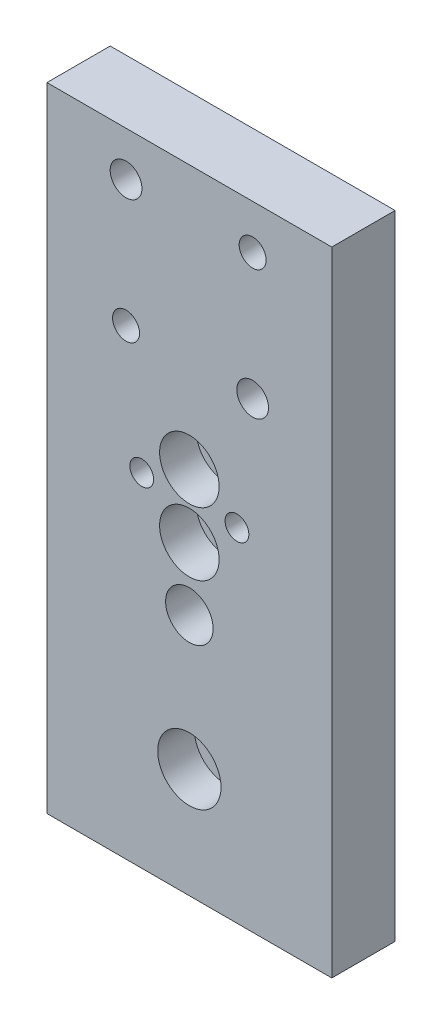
from build123d import *

# Parameters (mm, degrees)
SKETCH1_W             = 28.575
SKETCH1_H             = 63.5
EXTRUDE1_DEPTH        = 6.35
SKETCH2_R             = 1.59385
SKETCH2_R_2           = 1.78562
SKETCH2_R_3           = 2.38125
SKETCH2_R_4           = 1.8288
CUT_EXTRUDE1_DEPTH    = 36.390926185
SKETCH3_R             = 3.175
SKETCH3_R_2           = 2.9845
CUT_EXTRUDE2_DEPTH    = 3.683
SKETCH4_R             = 1.1938
CUT_EXTRUDE3_DEPTH    = 36.390926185
SKETCH5_R             = 3.302
CUT_EXTRUDE4_DEPTH    = 1.27
F_6_32_TAPPED_HOLE1_D = 2.7051


with BuildPart() as part:
    # Sketch1 → Extrude1 (new body)
    with BuildSketch(Plane.XY):
        Rectangle(SKETCH1_W, SKETCH1_H)
    extrude(amount=-EXTRUDE1_DEPTH)

    # Sketch2 → Cut-Extrude1 (cut, through all)
    with BuildSketch(Plane.XY):
        with Locations((-6.35, 27.305)):
            Circle(SKETCH2_R)
        with Locations((6.35, 14.605)):
            Circle(SKETCH2_R)
        with Locations((0, 5.2832)):
            Circle(SKETCH2_R_2)
        with Locations((0, -1.0668)):
            Circle(SKETCH2_R_2)
        with Locations((0, -7.366)):
            Circle(SKETCH2_R_3)
        with Locations((0, -20.7518)):
            Circle(SKETCH2_R_4)
    extrude(amount=-CUT_EXTRUDE1_DEPTH, mode=Mode.SUBTRACT)

    # Sketch3 → Cut-Extrude2 (cut)
    with BuildSketch(Plane.XY):
        with Locations((0, -20.7518)):
            Circle(SKETCH3_R)
        with Locations((0, -1.0668)):
            Circle(SKETCH3_R_2)
        with Locations((0, 5.2832)):
            Circle(SKETCH3_R_2)
    extrude(amount=-CUT_EXTRUDE2_DEPTH, mode=Mode.SUBTRACT)

    # Sketch4 → Cut-Extrude3 (cut, through all)
    with BuildSketch(Plane(origin=(0, 0, -6.35), x_dir=(-1, 0, 0), z_dir=(0, 0, -1))):
        with Locations((-4.7752, 2.6162)):
            Circle(SKETCH4_R)
        with Locations((4.7752, 2.6162)):
            Circle(SKETCH4_R)
    extrude(amount=-CUT_EXTRUDE3_DEPTH, mode=Mode.SUBTRACT)

    # Sketch5 → Cut-Extrude4 (cut)
    with BuildSketch(Plane(origin=(0, 0, -6.35), x_dir=(-1, 0, 0), z_dir=(0, 0, -1))):
        with Locations((0, -20.7518)):
            Circle(SKETCH5_R)
    extrude(amount=-CUT_EXTRUDE4_DEPTH, mode=Mode.SUBTRACT)

    # 6-32 Tapped Hole1 (through all)
    with Locations(Plane(origin=(0, 0, -6.35), x_dir=(-1, 0, 0), z_dir=(0, 0, -1))):
        with Locations((-6.35, 27.305), (6.35, 14.605)):
            Hole(F_6_32_TAPPED_HOLE1_D / 2)


solid = part.part
